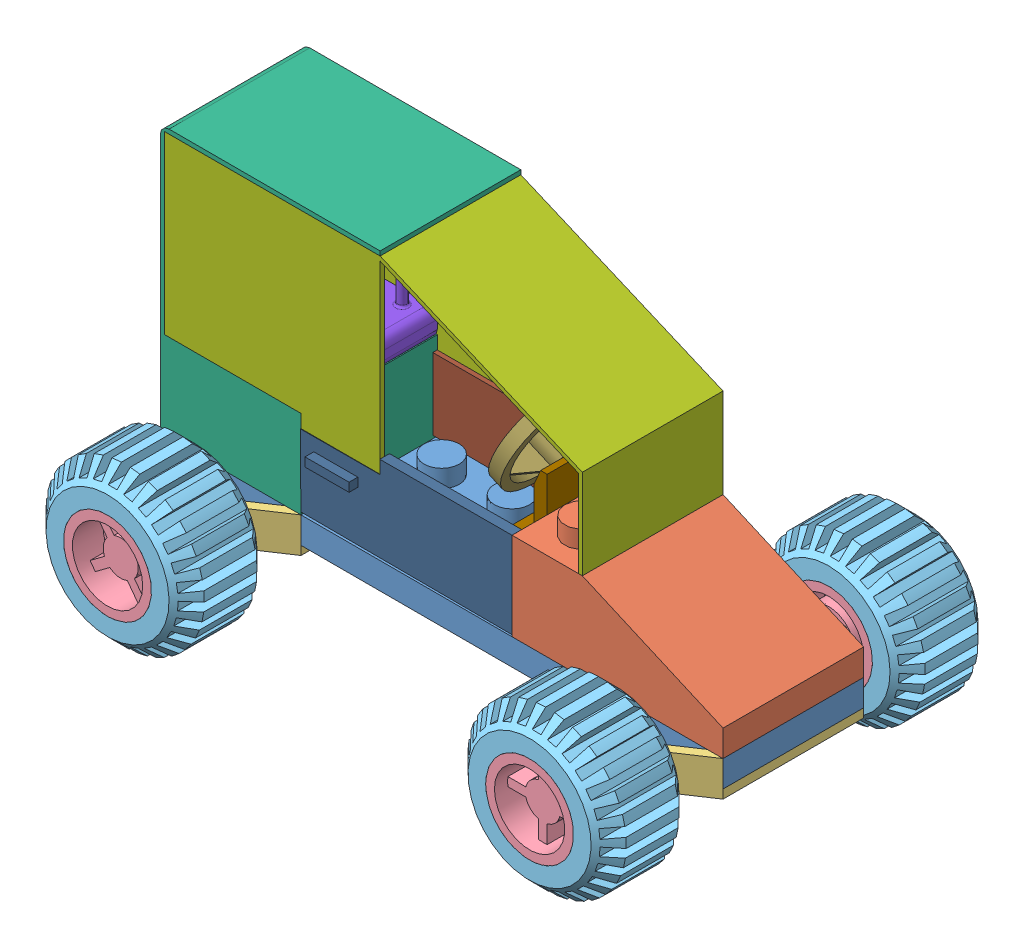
SolidWorks assembly Ensamblaje1.SLDASM, configuration Default (file format 6000). Lengths in mm.
Overall size (70.25 44.07 44).
27 component instances, 12 part files, 63 mates.
Components (placement in the parent):
- Cubo Largo-1: Cubo Largo.SLDPRT [Default] at origin size (64 5 16)
- Cubo-1: Cubo.SLDPRT [Default] at (-24 3 0) (suppressed, hidden)
- Frontal-1: Frontal.SLDPRT [Default] at (8 3 8) x (0 0 -1) z (1 0 0) size (16 12 24)
- Base Manejera-1: Base Manejera.SLDPRT [Default] at (4 3 -1) x (0 0 1) z (-1 0 0) (suppressed, hidden)
- Manejera-1: Manejera.SLDPRT [Default] at (6.875 16.1429 -1) x (0.386054 0.882409 0.268919) z (-0.916157 0.400819 0) (suppressed, hidden)
- Chasis-1: Chasis.SLDPRT [Default] at (-24 -1 0) x (0 0 1) z (-1 0 0) size (40 4 16)
- Chasis-2: Chasis.SLDPRT [Default] at (24 -1 0) x (0 0 -1) z (1 0 0) size (40 4 16)
- Rin-1: Rin.SLDPRT [Default] at (-24 1 17) x (0.801092 0.598541 0) z (0 0 -1) size (10 10 10)
- Rin-2: Rin.SLDPRT [Default] at (-24 1 -17) x (0.996583 -0.082595 0) z (0 0 1) size (10 10 10)
- Rin-3: Rin.SLDPRT [Default] at (24 1 17) x (0.002037 -0.999998 0) z (0 0 -1) size (10 10 10)
- Rin-4: Rin.SLDPRT [Default] at (24 1 -17) x (-0.955448 -0.295161 0) z (0 0 1) size (10 10 10)
- Llanta-1: Llanta.SLDPRT [Default] at (-24 1 22) x (0.936602 -0.350394 0) z (0 0 -1) size (18 17.99 10)
- Llanta-2: Llanta.SLDPRT [Default] at (24 1 -22) x (0.978098 0.208145 0) z (0 0 1) size (18 17.99 10)
- Llanta-3: Llanta.SLDPRT [Default] at (24 1 22) x (-0.136131 0.990691 0) z (0 0 -1) size (18 17.99 10)
- Llanta-4: Llanta.SLDPRT [Default] at (-24 1 -22) x (0.161729 -0.986835 0) z (0 0 1) size (18 17.99 10)
- Asiento-1: Asiento.SLDPRT [Default] at (-24 13 0) x (0 0 -1) z (1 0 0) (suppressed, hidden)
- Cubo-2: Cubo.SLDPRT [Default] at (-24 3 0) (suppressed, hidden)
- Cubo-3: Cubo.SLDPRT [Default] at (-24 3 0) x (0 0 -1) z (1 0 0)
- vidrio-1: vidrio.SLDPRT [Default] at (-19.5 13 0) size (47.5 21.5 16)
- Asiento-2: Asiento.SLDPRT [Default] at (-23.5 13 1) x (0 0 -1) z (1 0 0) (suppressed, hidden)
- Asiento-3: Asiento.SLDPRT [Default] at (-23.5 13 0) x (0 0 -1) z (1 0 0)
- puerta-1: puerta.SLDPRT [Default] at (0 0.223 6.8912) (suppressed, hidden)
- Base Manejera-2: Base Manejera.SLDPRT [Default] at (4 3 0) x (0 0 1) z (-1 0 0)
- puerta-2: puerta.SLDPRT [Default] at (-0.0028 0.5 6.9117) x (0.999997 0 -0.002554) z (0.002554 0 0.999997)
- puerta-3: puerta.SLDPRT [Default] at (25.6278 19.239 -7.3343) x (0.444035 -0.862847 -0.241511) z (0.027909 0.282729 -0.958794) (suppressed, hidden)
- Puerta Izq-1: Puerta Izq.SLDPRT [Default] at (0 0.5 -7.9966) x (1 0 -0.000427) z (0.000427 0 1) size (24 9.8 2)
- Manejera-2: Manejera.SLDPRT [Default] at (6.875 16.1429 0) x (0.076191 0.174151 0.981767) z (-0.916157 0.400819 0)
Mates (geometry in assembly coordinates):
- Coincidente1: coincident aligned: plane of Cubo Largo-1 through (-32 3 8) normal (0 0 1); plane of Cubo-1 through (-32 13 8) normal (0 0 1)
- Coincidente2: coincident aligned: plane of Cubo Largo-1 through (-32 3 -8) normal (-1 0 0); plane of Cubo-1 through (-32 13 -8) normal (-1 0 0)
- Coincidente3: coincident anti-aligned: plane of Cubo Largo-1 through (0 3 0) normal (0 1 0); plane of Cubo-1 through (-24 3 0) normal (0 -1 0)
- Coincidente4: coincident anti-aligned: plane of Cubo Largo-1 through (0 3 0) normal (0 1 0); plane of Frontal-1 through (8 3 -8) normal (0 -1 0)
- Coincidente5: coincident aligned: plane of Cubo Largo-1 through (-32 3 8) normal (0 0 1); plane of Frontal-1 through (8 3 8) normal (0 0 1)
- Coincidente6: coincident aligned: plane of Cubo Largo-1 through (32 3 -8) normal (1 0 0); plane of Frontal-1 through (32 3 -8) normal (1 0 0)
- Coincidente7: coincident: plane of Frontal-1 through (8 3 -8) normal (-1 0 0); plane of Base Manejera-2 through (8 6 -7) normal (1 0 0)
- Coincidente8: coincident: plane of Cubo Largo-1 through (0 3 0) normal (0 1 0); plane of Base Manejera-2 through (4 3 0) normal (0 -1 0)
- Coincidente9: coincident: plane of Frontal-1 through (8 3 -8) normal (0 0 -1); plane of Base Manejera-2 through (8 6 -7) normal (0 0 -1)
- Concéntrica1: concentric: cylinder of Base Manejera-2 through (3.6684 17.5457 0) axis (0.916157 -0.400819 0) radius 1.2; cylinder of Manejera-1 through (3.6684 17.5457 0) axis (0.916157 -0.400819 0) radius 1.2
- Coincidente10: coincident: plane of Base Manejera-2 through (3.6684 17.5457 0) normal (-0.916157 0.400819 0); plane of Manejera-1 through (3.6684 17.5457 0) normal (-0.916157 0.400819 0)
- Coincidente11: coincident aligned: plane of Cubo Largo-1 through (32 3 -8) normal (1 0 0); plane of Chasis-2 through (32 0 0) normal (1 0 0)
- Coincidente12: coincident aligned: plane of Cubo Largo-1 through (32 3 -8) normal (1 0 0); plane of Chasis-2 through (32 0 0) normal (1 0 0)
- Coincidente13: coincident anti-aligned: plane of Cubo Largo-1 through (-32 3 -8) normal (0 0 -1); plane of Chasis-2 through (30.1972 3 -8) normal (0 0 1)
- Coincidente14: coincident anti-aligned: plane of Cubo Largo-1 through (0 0 0) normal (0 -1 0); plane of Chasis-2 through (24 0 0) normal (0 1 0)
- Coincidente15: coincident anti-aligned: plane of Cubo Largo-1 through (0 0 0) normal (0 -1 0); plane of Chasis-1 through (-24 0 0) normal (0 1 0)
- Coincidente16: coincident aligned: plane of Cubo Largo-1 through (-32 3 -8) normal (-1 0 0); plane of Chasis-1 through (-32 0 0) normal (-1 0 0)
- Coincidente17: coincident anti-aligned: plane of Cubo Largo-1 through (-32 3 8) normal (0 0 1); plane of Chasis-1 through (-16 3 8) normal (0 0 -1)
- Concéntrica7: concentric aligned: cylinder of Rin-3 through (24 1 17) axis (0 0 1) radius 5; cylinder of Llanta-3 through (24 1 12) axis (0 0 1) radius 5
- Coincidente23: coincident aligned: plane of Rin-3 through (20 0.9919 12) normal (0 0 -1); plane of Llanta-3 through (24 1 12) normal (0 0 -1)
- Concéntrica8: concentric aligned: cylinder of Rin-4 through (24 1 -17) axis (0 0 -1) radius 5; cylinder of Llanta-2 through (24 1 -12) axis (0 0 -1) radius 5
- Coincidente24: coincident aligned: plane of Rin-4 through (25.1806 -2.8218 -12) normal (0 0 1); plane of Llanta-2 through (24 1 -12) normal (0 0 1)
- Concéntrica9: concentric aligned: cylinder of Rin-1 through (-24 1 17) axis (0 0 1) radius 5; cylinder of Llanta-1 through (-24 1 12) axis (0 0 1) radius 5
- Coincidente25: coincident aligned: plane of Rin-1 through (-21.6058 -2.2044 12) normal (0 0 -1); plane of Llanta-1 through (-24 1 12) normal (0 0 -1)
- Concéntrica10: concentric aligned: cylinder of Rin-2 through (-24 1 -17) axis (0 0 -1) radius 5; cylinder of Llanta-4 through (-24 1 -12) axis (0 0 -1) radius 5
- Coincidente26: coincident aligned: plane of Rin-2 through (-23.6696 4.9863 -12) normal (0 0 1); plane of Llanta-4 through (-24 1 -12) normal (0 0 1)
- Coincidente27: coincident anti-aligned: plane of Chasis-2 through (24 1 20) normal (0 0 1); plane of Rin-3 through (24 1 20) normal (0 0 -1)
- Concéntrica11: concentric aligned: cylinder of Chasis-2 through (24 1 20) axis (0 0 -1) radius 1.5; cylinder of Rin-3 through (24 1 20) axis (0 0 -1) radius 1.5
- Concéntrica13: concentric aligned: cylinder of Chasis-2 through (24 1 -20) axis (0 0 1) radius 1.5; cylinder of Rin-4 through (24 1 -20) axis (0 0 1) radius 1.5
- Coincidente29: coincident anti-aligned: plane of Chasis-2 through (24 1 -20) normal (0 0 -1); plane of Rin-4 through (24 1 -20) normal (0 0 1)
- Coincidente30: coincident anti-aligned: plane of Chasis-1 through (-24 1 20) normal (0 0 1); plane of Rin-1 through (-24 1 20) normal (0 0 -1)
- Concéntrica14: concentric aligned: cylinder of Chasis-1 through (-24 1 20) axis (0 0 -1) radius 1.5; cylinder of Rin-1 through (-24 1 20) axis (0 0 -1) radius 1.5
- Coincidente31: coincident anti-aligned: plane of Chasis-1 through (-24 1 -20) normal (0 0 -1); plane of Rin-2 through (-24 1 -20) normal (0 0 1)
- Concéntrica15: concentric aligned: cylinder of Chasis-1 through (-24 1 -20) axis (0 0 1) radius 1.5; cylinder of Rin-2 through (-24 1 -20) axis (0 0 1) radius 1.5
- Coincidente32: coincident: plane of Cubo-1 through (-32 13 8) normal (0 0 1); plane of Asiento-1 through (-32 16 8) normal (0 0 1)
- Coincidente33: coincident: plane of Cubo-1 through (-32 13 -8) normal (-1 0 0); plane of Asiento-1 through (-32 16 8) normal (-1 0 0)
- Coincidente34: coincident anti-aligned: plane of Cubo-1 through (-24 13 0) normal (0 1 0); plane of Asiento-1 through (-24 13 0) normal (0 -1 0)
- Coincidente36: coincident aligned: plane of Cubo Largo-1 through (-32 3 8) normal (0 0 1); plane of Cubo-2 through (-32 13 8) normal (0 0 1)
- Coincidente37: coincident aligned: plane of Cubo Largo-1 through (-32 3 -8) normal (-1 0 0); plane of Cubo-2 through (-32 13 -8) normal (-1 0 0)
- Coincidente38: coincident anti-aligned: plane of Cubo Largo-1 through (0 3 0) normal (0 1 0); plane of Cubo-2 through (-24 3 0) normal (0 -1 0)
- Coincidente39: coincident aligned: plane of Cubo Largo-1 through (-32 3 -8) normal (-1 0 0); plane of Cubo-3 through (-32 13 8) normal (-1 0 0)
- Coincidente40: coincident aligned: plane of Cubo Largo-1 through (-32 3 -8) normal (0 0 -1); plane of Cubo-3 through (-32 13 -8) normal (0 0 -1)
- Coincidente41: coincident anti-aligned: plane of Cubo Largo-1 through (0 3 0) normal (0 1 0); plane of Cubo-3 through (-24 3 0) normal (0 -1 0)
- Coincidente46: coincident aligned: plane of Cubo-3 through (-32 13 8) normal (0 0 1); plane of Asiento-2 through (-31.5 16 8) normal (0 0 1)
- Coincidente47: coincident anti-aligned: plane of Cubo-3 through (-24 13 0) normal (0 1 0); plane of Asiento-2 through (-23.5 13 1) normal (0 -1 0)
- Coincidente48: coincident anti-aligned: plane of Cubo-3 through (-31.5 33 -7.5) normal (1 0 0); plane of Asiento-2 through (-31.5 16 8) normal (-1 0 0)
- Coincidente49: coincident anti-aligned: plane of Cubo-3 through (-24 13 0) normal (0 1 0); plane of Asiento-3 through (-23.5 13 0) normal (0 -1 0)
- Coincidente50: coincident anti-aligned: plane of Cubo-3 through (-31.5 33 -7.5) normal (1 0 0); plane of Asiento-3 through (-31.5 16 7) normal (-1 0 0)
- Distancia1: distance = 1 mm aligned: plane of Asiento-3 through (-31.5 16 7) normal (0 0 1); plane of Cubo-3 through (-32 13 8) normal (0 0 1)
- Coincidente52: coincident aligned: plane of Cubo-3 through (-32 13 8) normal (0 0 1); plane of vidrio-1 through (-31.5 33 8) normal (0 0 1)
- Coincidente53: coincident anti-aligned: plane of Cubo-3 through (-31.5 33 -7.5) normal (1 0 0); plane of vidrio-1 through (-31.5 33 7.5) normal (-1 0 0)
- Coincidente54: coincident anti-aligned: plane of Cubo-3 through (-24 33 0) normal (0 -1 0); plane of vidrio-1 through (-19.5 33 0) normal (0 1 0)
- Coincidente55: coincident aligned: line of Frontal-1 through (8 3 8) axis (0 1 0); line of puerta-1 through (8 4.918 8) axis (0 1 0)
- Paralelo2: parallel anti-aligned: line of Frontal-1 through (8 13 8) axis (1 0 0); line of puerta-1 through (8 14.718 6.8912) axis (-1 0 0)
- Coincidente61: coincident anti-aligned: plane of Frontal-1 through (8 3 -8) normal (-1 0 0); plane of Base Manejera-2 through (8 6 -7) normal (1 0 0)
- Distancia2: distance = 1 mm aligned: plane of Base Manejera-2 through (8 6 7) normal (0 0 1); plane of Cubo Largo-1 through (-32 3 8) normal (0 0 1)
- Coincidente63: coincident anti-aligned: plane of Cubo Largo-1 through (0 3 0) normal (0 1 0); plane of Base Manejera-2 through (4 3 0) normal (0 -1 0)
- Coincidente67: coincident aligned: line of Frontal-1 through (8 3 8) axis (0 1 0); line of puerta-2 through (8 3.2 8) axis (0 1 0)
- Coincidente68: coincident aligned: plane of Frontal-1 through (8 13 -8) normal (0 1 0); plane of puerta-2 through (8 13 8) normal (0 1 0)
- Coincidente69: coincident aligned: line of Frontal-1 through (8 3 -8) axis (0 1 0); line of Puerta Izq-1 through (8 3.2 -8) axis (0 1 0)
- Coincidente70: coincident aligned: plane of Frontal-1 through (8 13 -8) normal (0 1 0); plane of Puerta Izq-1 through (8.0004 13 -7) normal (0 1 0)
- Concéntrica16: concentric aligned: cylinder of Base Manejera-2 through (3.6684 17.5457 0) axis (0.916157 -0.400819 0) radius 1.2; cylinder of Manejera-2 through (3.6684 17.5457 0) axis (0.916157 -0.400819 0) radius 1.2
- Coincidente72: coincident aligned: plane of Base Manejera-2 through (3.6684 17.5457 0) normal (-0.916157 0.400819 0); plane of Manejera-2 through (3.6684 17.5457 0) normal (-0.916157 0.400819 0)
